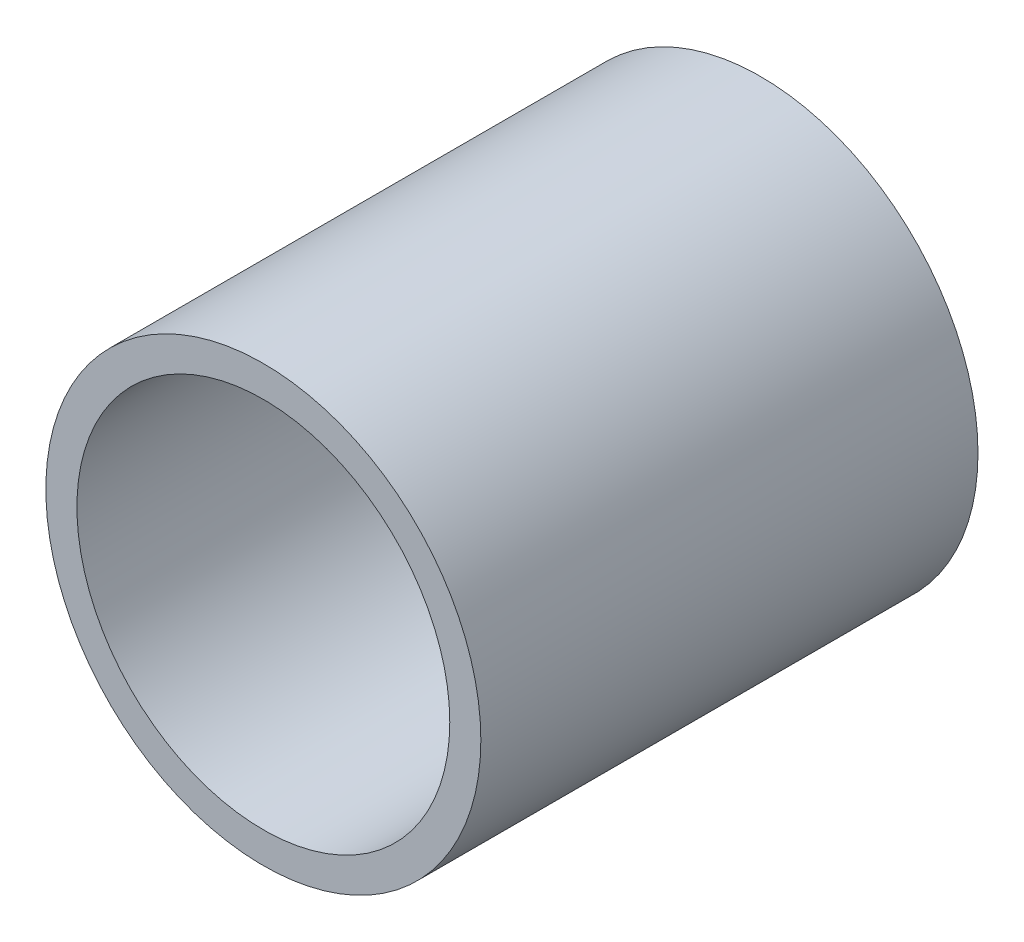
ISO-10303-21;
HEADER;
FILE_DESCRIPTION(('STEP AP214'),'2;1');
FILE_NAME('part.step','',(''),(''),'','','');
FILE_SCHEMA(('AUTOMOTIVE_DESIGN { 1 0 10303 214 1 1 1 1 }'));
ENDSEC;
DATA;
#1=APPLICATION_CONTEXT('core data for automotive mechanical design processes');
#2=APPLICATION_PROTOCOL_DEFINITION('international standard','automotive_design',2000,#1);
#3=PRODUCT_CONTEXT('',#1,'mechanical');
#4=PRODUCT('Part','Part','',(#3));
#5=PRODUCT_RELATED_PRODUCT_CATEGORY('part','',(#4));
#6=PRODUCT_DEFINITION_FORMATION('','',#4);
#7=PRODUCT_DEFINITION_CONTEXT('part definition',#1,'design');
#8=PRODUCT_DEFINITION('design','',#6,#7);
#9=PRODUCT_DEFINITION_SHAPE('','',#8);
#10=(LENGTH_UNIT() NAMED_UNIT(*) SI_UNIT(.MILLI.,.METRE.));
#11=(NAMED_UNIT(*) PLANE_ANGLE_UNIT() SI_UNIT($,.RADIAN.));
#12=(NAMED_UNIT(*) SI_UNIT($,.STERADIAN.) SOLID_ANGLE_UNIT());
#13=UNCERTAINTY_MEASURE_WITH_UNIT(LENGTH_MEASURE(1.E-05),#10,'distance_accuracy_value','');
#14=(GEOMETRIC_REPRESENTATION_CONTEXT(3) GLOBAL_UNCERTAINTY_ASSIGNED_CONTEXT((#13)) GLOBAL_UNIT_ASSIGNED_CONTEXT((#10,
#11,#12)) REPRESENTATION_CONTEXT('',''));
#15=CARTESIAN_POINT('',(0.,0.,0.));
#16=DIRECTION('',(0.,0.,1.));
#17=DIRECTION('',(1.,0.,0.));
#18=AXIS2_PLACEMENT_3D('',#15,#16,#17);
#19=CARTESIAN_POINT('',(0.,0.,0.));
#20=DIRECTION('',(0.,0.,1.));
#21=DIRECTION('',(1.,0.,0.));
#22=AXIS2_PLACEMENT_3D('',#19,#20,#21);
#23=CYLINDRICAL_SURFACE('',#22,6.);
#24=CARTESIAN_POINT('',(0.,0.,16.));
#25=DIRECTION('',(0.,0.,1.));
#26=DIRECTION('',(1.,0.,0.));
#27=AXIS2_PLACEMENT_3D('',#24,#25,#26);
#28=CIRCLE('',#27,6.);
#29=CARTESIAN_POINT('',(6.,0.,16.));
#30=VERTEX_POINT('',#29);
#31=EDGE_CURVE('E27',#30,#30,#28,.T.);
#32=ORIENTED_EDGE('',*,*,#31,.T.);
#33=EDGE_LOOP('',(#32));
#34=FACE_BOUND('',#33,.T.);
#35=CARTESIAN_POINT('',(0.,0.,0.));
#36=DIRECTION('',(0.,0.,1.));
#37=DIRECTION('',(1.,0.,0.));
#38=AXIS2_PLACEMENT_3D('',#35,#36,#37);
#39=CIRCLE('',#38,6.);
#40=CARTESIAN_POINT('',(6.,0.,0.));
#41=VERTEX_POINT('',#40);
#42=EDGE_CURVE('E18',#41,#41,#39,.T.);
#43=ORIENTED_EDGE('',*,*,#42,.F.);
#44=EDGE_LOOP('',(#43));
#45=FACE_BOUND('',#44,.T.);
#46=ADVANCED_FACE('F14',(#34,#45),#23,.F.);
#47=CARTESIAN_POINT('',(0.,0.,0.));
#48=DIRECTION('',(0.,0.,-1.));
#49=DIRECTION('',(-1.,0.,0.));
#50=AXIS2_PLACEMENT_3D('',#47,#48,#49);
#51=PLANE('',#50);
#52=CARTESIAN_POINT('',(0.,0.,0.));
#53=DIRECTION('',(0.,0.,1.));
#54=DIRECTION('',(1.,0.,0.));
#55=AXIS2_PLACEMENT_3D('',#52,#53,#54);
#56=CIRCLE('',#55,7.);
#57=CARTESIAN_POINT('',(7.,0.,0.));
#58=VERTEX_POINT('',#57);
#59=EDGE_CURVE('E22',#58,#58,#56,.T.);
#60=ORIENTED_EDGE('',*,*,#59,.F.);
#61=EDGE_LOOP('',(#60));
#62=FACE_BOUND('',#61,.T.);
#63=ORIENTED_EDGE('',*,*,#42,.T.);
#64=EDGE_LOOP('',(#63));
#65=FACE_BOUND('',#64,.T.);
#66=ADVANCED_FACE('F35',(#62,#65),#51,.T.);
#67=CARTESIAN_POINT('',(0.,0.,16.));
#68=DIRECTION('',(0.,0.,-1.));
#69=DIRECTION('',(-1.,0.,0.));
#70=AXIS2_PLACEMENT_3D('',#67,#68,#69);
#71=PLANE('',#70);
#72=CARTESIAN_POINT('',(0.,0.,16.));
#73=DIRECTION('',(0.,0.,1.));
#74=DIRECTION('',(1.,0.,0.));
#75=AXIS2_PLACEMENT_3D('',#72,#73,#74);
#76=CIRCLE('',#75,7.);
#77=CARTESIAN_POINT('',(7.,0.,16.));
#78=VERTEX_POINT('',#77);
#79=EDGE_CURVE('E9',#78,#78,#76,.F.);
#80=ORIENTED_EDGE('',*,*,#79,.F.);
#81=EDGE_LOOP('',(#80));
#82=FACE_BOUND('',#81,.T.);
#83=ORIENTED_EDGE('',*,*,#31,.F.);
#84=EDGE_LOOP('',(#83));
#85=FACE_BOUND('',#84,.T.);
#86=ADVANCED_FACE('F42',(#82,#85),#71,.F.);
#87=CARTESIAN_POINT('',(0.,0.,0.));
#88=DIRECTION('',(0.,0.,1.));
#89=DIRECTION('',(1.,0.,0.));
#90=AXIS2_PLACEMENT_3D('',#87,#88,#89);
#91=CYLINDRICAL_SURFACE('',#90,7.);
#92=ORIENTED_EDGE('',*,*,#59,.T.);
#93=EDGE_LOOP('',(#92));
#94=FACE_BOUND('',#93,.T.);
#95=ORIENTED_EDGE('',*,*,#79,.T.);
#96=EDGE_LOOP('',(#95));
#97=FACE_BOUND('',#96,.T.);
#98=ADVANCED_FACE('F16',(#94,#97),#91,.T.);
#99=CLOSED_SHELL('',(#46,#66,#86,#98));
#100=MANIFOLD_SOLID_BREP('B1',#99);
#101=ADVANCED_BREP_SHAPE_REPRESENTATION('',(#18,#100),#14);
#102=SHAPE_DEFINITION_REPRESENTATION(#9,#101);
ENDSEC;
END-ISO-10303-21;
